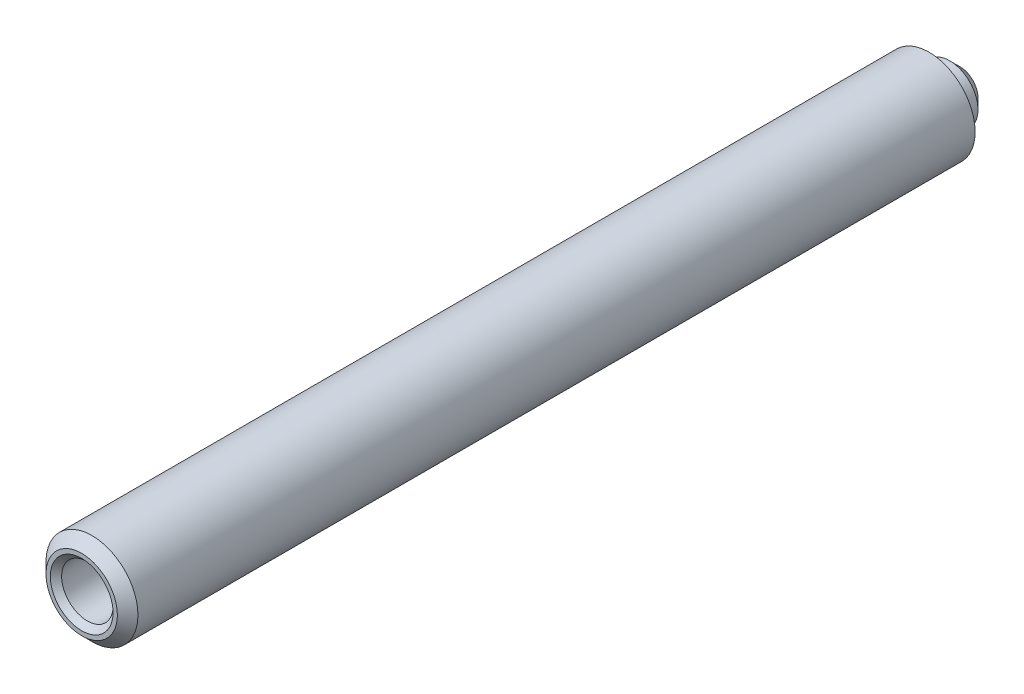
ISO-10303-21;
HEADER;
FILE_DESCRIPTION(('STEP AP214'),'2;1');
FILE_NAME('part.step','',(''),(''),'','','');
FILE_SCHEMA(('AUTOMOTIVE_DESIGN { 1 0 10303 214 1 1 1 1 }'));
ENDSEC;
DATA;
#1=APPLICATION_CONTEXT('core data for automotive mechanical design processes');
#2=APPLICATION_PROTOCOL_DEFINITION('international standard','automotive_design',2000,#1);
#3=PRODUCT_CONTEXT('',#1,'mechanical');
#4=PRODUCT('Part','Part','',(#3));
#5=PRODUCT_RELATED_PRODUCT_CATEGORY('part','',(#4));
#6=PRODUCT_DEFINITION_FORMATION('','',#4);
#7=PRODUCT_DEFINITION_CONTEXT('part definition',#1,'design');
#8=PRODUCT_DEFINITION('design','',#6,#7);
#9=PRODUCT_DEFINITION_SHAPE('','',#8);
#10=(LENGTH_UNIT() NAMED_UNIT(*) SI_UNIT(.MILLI.,.METRE.));
#11=(NAMED_UNIT(*) PLANE_ANGLE_UNIT() SI_UNIT($,.RADIAN.));
#12=(NAMED_UNIT(*) SI_UNIT($,.STERADIAN.) SOLID_ANGLE_UNIT());
#13=UNCERTAINTY_MEASURE_WITH_UNIT(LENGTH_MEASURE(1.E-05),#10,'distance_accuracy_value','');
#14=(GEOMETRIC_REPRESENTATION_CONTEXT(3) GLOBAL_UNCERTAINTY_ASSIGNED_CONTEXT((#13)) GLOBAL_UNIT_ASSIGNED_CONTEXT((#10,
#11,#12)) REPRESENTATION_CONTEXT('',''));
#15=CARTESIAN_POINT('',(0.,0.,0.));
#16=DIRECTION('',(0.,0.,1.));
#17=DIRECTION('',(1.,0.,0.));
#18=AXIS2_PLACEMENT_3D('',#15,#16,#17);
#19=CARTESIAN_POINT('',(0.,0.,-9.5));
#20=DIRECTION('',(0.,0.,1.));
#21=DIRECTION('',(1.,0.,0.));
#22=AXIS2_PLACEMENT_3D('',#19,#20,#21);
#23=CYLINDRICAL_SURFACE('',#22,1.3765);
#24=CARTESIAN_POINT('',(0.,0.,-9.));
#25=DIRECTION('',(0.,0.,-1.));
#26=DIRECTION('',(-1.,0.,0.));
#27=AXIS2_PLACEMENT_3D('',#24,#25,#26);
#28=CIRCLE('',#27,1.3765);
#29=CARTESIAN_POINT('',(-1.3765,0.,-9.));
#30=VERTEX_POINT('',#29);
#31=EDGE_CURVE('E11',#30,#30,#28,.F.);
#32=ORIENTED_EDGE('',*,*,#31,.T.);
#33=EDGE_LOOP('',(#32));
#34=FACE_BOUND('',#33,.T.);
#35=CARTESIAN_POINT('',(0.,0.,-8.));
#36=DIRECTION('',(0.,0.,-1.));
#37=DIRECTION('',(-1.,0.,0.));
#38=AXIS2_PLACEMENT_3D('',#35,#36,#37);
#39=CIRCLE('',#38,1.3765);
#40=CARTESIAN_POINT('',(-1.3765,0.,-8.));
#41=VERTEX_POINT('',#40);
#42=EDGE_CURVE('E62',#41,#41,#39,.T.);
#43=ORIENTED_EDGE('',*,*,#42,.T.);
#44=EDGE_LOOP('',(#43));
#45=FACE_BOUND('',#44,.T.);
#46=ADVANCED_FACE('F38',(#34,#45),#23,.T.);
#47=CARTESIAN_POINT('',(0.,0.,-9.5));
#48=DIRECTION('',(0.,0.,-1.));
#49=DIRECTION('',(-1.,0.,0.));
#50=AXIS2_PLACEMENT_3D('',#47,#48,#49);
#51=PLANE('',#50);
#52=CARTESIAN_POINT('',(0.,0.,-9.5));
#53=DIRECTION('',(0.,0.,-1.));
#54=DIRECTION('',(-1.,0.,0.));
#55=AXIS2_PLACEMENT_3D('',#52,#53,#54);
#56=CIRCLE('',#55,0.876499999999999);
#57=CARTESIAN_POINT('',(-0.876499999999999,0.,-9.5));
#58=VERTEX_POINT('',#57);
#59=EDGE_CURVE('E46',#58,#58,#56,.T.);
#60=ORIENTED_EDGE('',*,*,#59,.T.);
#61=EDGE_LOOP('',(#60));
#62=FACE_BOUND('',#61,.T.);
#63=ADVANCED_FACE('F79',(#62),#51,.T.);
#64=CARTESIAN_POINT('',(0.,0.,74.7215346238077));
#65=DIRECTION('',(0.,0.,-1.));
#66=DIRECTION('',(-1.,0.,0.));
#67=AXIS2_PLACEMENT_3D('',#64,#65,#66);
#68=CYLINDRICAL_SURFACE('',#67,2.235);
#69=CARTESIAN_POINT('',(0.,0.,32.7));
#70=DIRECTION('',(0.,0.,1.));
#71=DIRECTION('',(1.,0.,0.));
#72=AXIS2_PLACEMENT_3D('',#69,#70,#71);
#73=CIRCLE('',#72,2.235);
#74=CARTESIAN_POINT('',(2.235,0.,32.7));
#75=VERTEX_POINT('',#74);
#76=EDGE_CURVE('E74',#75,#75,#73,.F.);
#77=ORIENTED_EDGE('',*,*,#76,.T.);
#78=EDGE_LOOP('',(#77));
#79=FACE_BOUND('',#78,.T.);
#80=CARTESIAN_POINT('',(0.,0.,-8.));
#81=DIRECTION('',(0.,0.,1.));
#82=DIRECTION('',(1.,0.,0.));
#83=AXIS2_PLACEMENT_3D('',#80,#81,#82);
#84=CIRCLE('',#83,2.235);
#85=CARTESIAN_POINT('',(2.235,0.,-8.));
#86=VERTEX_POINT('',#85);
#87=EDGE_CURVE('E58',#86,#86,#84,.T.);
#88=ORIENTED_EDGE('',*,*,#87,.T.);
#89=EDGE_LOOP('',(#88));
#90=FACE_BOUND('',#89,.T.);
#91=ADVANCED_FACE('F96',(#79,#90),#68,.T.);
#92=CARTESIAN_POINT('',(0.,0.,-8.));
#93=DIRECTION('',(0.,0.,1.));
#94=DIRECTION('',(1.,0.,0.));
#95=AXIS2_PLACEMENT_3D('',#92,#93,#94);
#96=PLANE('',#95);
#97=ORIENTED_EDGE('',*,*,#42,.F.);
#98=EDGE_LOOP('',(#97));
#99=FACE_BOUND('',#98,.T.);
#100=ORIENTED_EDGE('',*,*,#87,.F.);
#101=EDGE_LOOP('',(#100));
#102=FACE_BOUND('',#101,.T.);
#103=ADVANCED_FACE('F107',(#99,#102),#96,.F.);
#104=CARTESIAN_POINT('',(0.,0.,33.2));
#105=DIRECTION('',(0.,0.,1.));
#106=DIRECTION('',(1.,0.,0.));
#107=AXIS2_PLACEMENT_3D('',#104,#105,#106);
#108=PLANE('',#107);
#109=CARTESIAN_POINT('',(0.,0.,33.2));
#110=DIRECTION('',(0.,0.,1.));
#111=DIRECTION('',(1.,0.,0.));
#112=AXIS2_PLACEMENT_3D('',#109,#110,#111);
#113=CIRCLE('',#112,1.525);
#114=CARTESIAN_POINT('',(1.525,0.,33.2));
#115=VERTEX_POINT('',#114);
#116=EDGE_CURVE('E65',#115,#115,#113,.T.);
#117=ORIENTED_EDGE('',*,*,#116,.F.);
#118=EDGE_LOOP('',(#117));
#119=FACE_BOUND('',#118,.T.);
#120=CARTESIAN_POINT('',(0.,0.,33.2));
#121=DIRECTION('',(0.,0.,1.));
#122=DIRECTION('',(1.,0.,0.));
#123=AXIS2_PLACEMENT_3D('',#120,#121,#122);
#124=CIRCLE('',#123,1.73500000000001);
#125=CARTESIAN_POINT('',(1.73500000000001,0.,33.2));
#126=VERTEX_POINT('',#125);
#127=EDGE_CURVE('E71',#126,#126,#124,.T.);
#128=ORIENTED_EDGE('',*,*,#127,.T.);
#129=EDGE_LOOP('',(#128));
#130=FACE_BOUND('',#129,.T.);
#131=ADVANCED_FACE('F87',(#119,#130),#108,.T.);
#132=CARTESIAN_POINT('',(0.,0.,33.2));
#133=DIRECTION('',(0.,0.,-1.));
#134=DIRECTION('',(-1.,0.,0.));
#135=AXIS2_PLACEMENT_3D('',#132,#133,#134);
#136=CONICAL_SURFACE('',#135,1.73500000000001,0.785398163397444);
#137=ORIENTED_EDGE('',*,*,#76,.F.);
#138=EDGE_LOOP('',(#137));
#139=FACE_BOUND('',#138,.T.);
#140=ORIENTED_EDGE('',*,*,#127,.F.);
#141=EDGE_LOOP('',(#140));
#142=FACE_BOUND('',#141,.T.);
#143=ADVANCED_FACE('F82',(#139,#142),#136,.T.);
#144=CARTESIAN_POINT('',(0.,0.,-9.5));
#145=DIRECTION('',(0.,0.,1.));
#146=DIRECTION('',(1.,0.,0.));
#147=AXIS2_PLACEMENT_3D('',#144,#145,#146);
#148=CONICAL_SURFACE('',#147,0.876499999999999,0.785398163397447);
#149=ORIENTED_EDGE('',*,*,#31,.F.);
#150=EDGE_LOOP('',(#149));
#151=FACE_BOUND('',#150,.T.);
#152=ORIENTED_EDGE('',*,*,#59,.F.);
#153=EDGE_LOOP('',(#152));
#154=FACE_BOUND('',#153,.T.);
#155=ADVANCED_FACE('F41',(#151,#154),#148,.T.);
#156=CARTESIAN_POINT('',(0.,0.,24.7));
#157=DIRECTION('',(0.,0.,1.));
#158=DIRECTION('',(1.,0.,0.));
#159=AXIS2_PLACEMENT_3D('',#156,#157,#158);
#160=CONICAL_SURFACE('',#159,1.24999999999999,1.02974425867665);
#161=CARTESIAN_POINT('',(0.,0.,23.9489242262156));
#162=VERTEX_POINT('',#161);
#163=VERTEX_LOOP('',#162);
#164=FACE_BOUND('',#163,.T.);
#165=CARTESIAN_POINT('',(0.,0.,24.7));
#166=DIRECTION('',(0.,0.,1.));
#167=DIRECTION('',(1.,0.,0.));
#168=AXIS2_PLACEMENT_3D('',#165,#166,#167);
#169=CIRCLE('',#168,1.24999999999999);
#170=CARTESIAN_POINT('',(1.24999999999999,0.,24.7));
#171=VERTEX_POINT('',#170);
#172=EDGE_CURVE('E56',#171,#171,#169,.T.);
#173=ORIENTED_EDGE('',*,*,#172,.T.);
#174=EDGE_LOOP('',(#173));
#175=FACE_BOUND('',#174,.T.);
#176=ADVANCED_FACE('F49',(#164,#175),#160,.F.);
#177=CARTESIAN_POINT('',(0.,0.,33.2));
#178=DIRECTION('',(0.,0.,1.));
#179=DIRECTION('',(1.,0.,0.));
#180=AXIS2_PLACEMENT_3D('',#177,#178,#179);
#181=CYLINDRICAL_SURFACE('',#180,1.24999999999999);
#182=ORIENTED_EDGE('',*,*,#172,.F.);
#183=EDGE_LOOP('',(#182));
#184=FACE_BOUND('',#183,.T.);
#185=CARTESIAN_POINT('',(0.,0.,32.925));
#186=DIRECTION('',(0.,0.,1.));
#187=DIRECTION('',(1.,0.,0.));
#188=AXIS2_PLACEMENT_3D('',#185,#186,#187);
#189=CIRCLE('',#188,1.25);
#190=CARTESIAN_POINT('',(1.25,0.,32.925));
#191=VERTEX_POINT('',#190);
#192=EDGE_CURVE('E59',#191,#191,#189,.T.);
#193=ORIENTED_EDGE('',*,*,#192,.T.);
#194=EDGE_LOOP('',(#193));
#195=FACE_BOUND('',#194,.T.);
#196=ADVANCED_FACE('F52',(#184,#195),#181,.F.);
#197=CARTESIAN_POINT('',(0.,0.,33.2));
#198=DIRECTION('',(0.,0.,1.));
#199=DIRECTION('',(1.,0.,0.));
#200=AXIS2_PLACEMENT_3D('',#197,#198,#199);
#201=CONICAL_SURFACE('',#200,1.525,0.785398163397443);
#202=ORIENTED_EDGE('',*,*,#192,.F.);
#203=EDGE_LOOP('',(#202));
#204=FACE_BOUND('',#203,.T.);
#205=ORIENTED_EDGE('',*,*,#116,.T.);
#206=EDGE_LOOP('',(#205));
#207=FACE_BOUND('',#206,.T.);
#208=ADVANCED_FACE('F117',(#204,#207),#201,.F.);
#209=CLOSED_SHELL('',(#46,#63,#91,#103,#131,#143,#155,#176,#196,#208));
#210=MANIFOLD_SOLID_BREP('B2',#209);
#211=ADVANCED_BREP_SHAPE_REPRESENTATION('',(#18,#210),#14);
#212=SHAPE_DEFINITION_REPRESENTATION(#9,#211);
ENDSEC;
END-ISO-10303-21;
